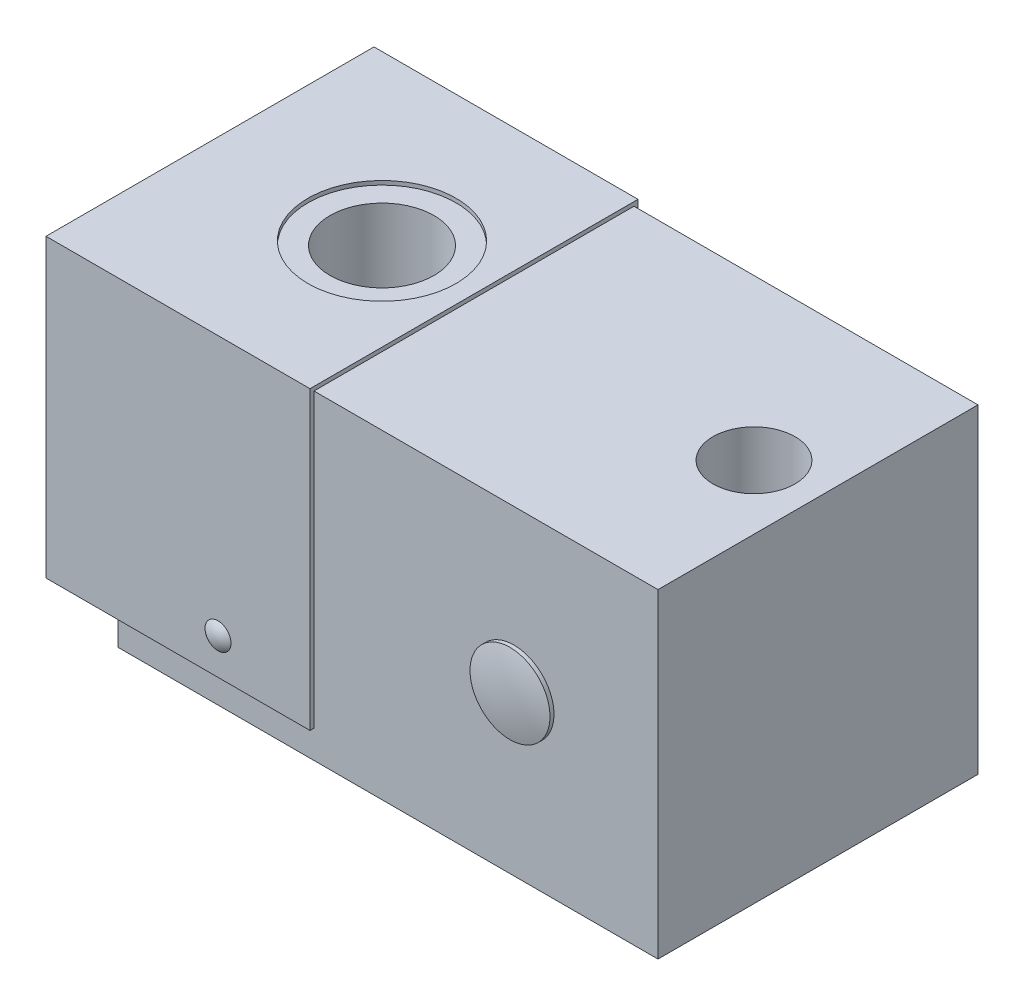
from build123d import *
from build123d.topology import SkipClean

# Parameters (mm, degrees)
EXTRUDE1_DEPTH           = 81
CUT_EXTRUDE1_DEPTH       = 40
CUT_EXTRUDE1_DEPTH_BACK  = 40
SKETCH2_W                = 86
SKETCH2_H                = 2
CUT_EXTRUDE2_DEPTH       = 40
CUT_EXTRUDE2_DEPTH_BACK  = 40
SKETCH3_W                = 33
SKETCH3_H                = 80
SKETCH4_W                = 2
SKETCH4_H                = 7
CUT_EXTRUDE3_DEPTH       = 66
SKETCH5_W                = 2
SKETCH5_H                = 7
CUT_EXTRUDE4_DEPTH       = 66
SKETCH7_W                = 10.25
SKETCH7_H                = 80
CUT_EXTRUDE5_DEPTH       = 5
REVOLVE3_ANGLE           = 90
REVOLVE3_OTHER_WAY_ANGLE = 90
REVOLVE4_ANGLE           = 90
REVOLVE4_OTHER_WAY_ANGLE = 90
SKETCH20_R               = 4.55
CUT_EXTRUDE6_DEPTH       = 4.5
CUT_EXTRUDE7_DEPTH       = 5


with BuildPart() as part:
    # Sketch1 → Extrude1 (new body)
    with BuildSketch(Plane(origin=(0, 0, 0), x_dir=(-1, 0, 0), z_dir=(0, 1, 0))):
        Polygon((66, 41), (0, 41), (0, 40), (-86, 40), (-86, -40), (0, -40), (0, -41), (66, -41), align=None)
    extrude(amount=EXTRUDE1_DEPTH)

    # Sketch2 → Cut-Extrude1 (cut, two sides: drawn at the far end of the back side and taken through both)
    with BuildSketch(Plane.XY.offset(-CUT_EXTRUDE1_DEPTH_BACK)):
        with Locations((43, 81)):
            Rectangle(SKETCH2_W, SKETCH2_H)
    extrude(amount=CUT_EXTRUDE1_DEPTH + CUT_EXTRUDE1_DEPTH_BACK, mode=Mode.SUBTRACT)

    # Sketch3 → Cut-Extrude2 (cut, two sides: drawn at the far end of the back side and taken through both)
    with BuildSketch(Plane.XY.offset(-CUT_EXTRUDE2_DEPTH_BACK)):
        with Locations((-65.5, 40)):
            Rectangle(SKETCH3_W, SKETCH3_H)
    extrude(amount=CUT_EXTRUDE2_DEPTH + CUT_EXTRUDE2_DEPTH_BACK, mode=Mode.SUBTRACT)

    # Sketch4 → Cut-Extrude3 (cut)
    with BuildSketch(Plane(origin=(0, 0, 0), x_dir=(0, 0, -1), z_dir=(1, 0, 0))):
        with Locations((41, 3.5)):
            Rectangle(SKETCH4_W, SKETCH4_H)
    extrude(amount=-CUT_EXTRUDE3_DEPTH, mode=Mode.SUBTRACT)

    # Sketch5 → Cut-Extrude4 (cut)
    with BuildSketch(Plane(origin=(0, 0, 0), x_dir=(0, 0, -1), z_dir=(1, 0, 0))):
        with Locations((-41, 3.5)):
            Rectangle(SKETCH5_W, SKETCH5_H)
    extrude(amount=-CUT_EXTRUDE4_DEPTH, mode=Mode.SUBTRACT)

    # Sketch6 → Cut-Revolve1 (revolve, cut)
    with BuildSketch(Plane.XY, mode=Mode.PRIVATE) as cut_revolve1_sk:
        Polygon((-76, 40), (-76, 62), (14, 62), (14, 60.25), (44, 60.25), (53.442730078, 40), align=None)
    revolve(cut_revolve1_sk.sketch.rotate(Axis((53.442730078, 40, 0), (-1, 0, 0)), 270), axis=Axis((53.442730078, 40, 0), (-1, 0, 0)), mode=Mode.SUBTRACT)

    # Sketch7 → Cut-Revolve2 (revolve, cut)
    with BuildSketch(Plane.XY, mode=Mode.PRIVATE) as cut_revolve2_sk:
        with Locations((75.125, 40)):
            Rectangle(SKETCH7_W, SKETCH7_H)
    revolve(cut_revolve2_sk.sketch.rotate(Axis((70, 0, 0), (0, 1, 0)), 270), axis=Axis((70, 0, 0), (0, 1, 0)), mode=Mode.SUBTRACT)

    # Sketch8 → Cut-Revolve3 (revolve, cut)
    with BuildSketch(Plane.XY.offset(30), mode=Mode.PRIVATE) as cut_revolve3_sk:
        Polygon((70, 30.91735091), (75.053, 28), (75.053, 0.947), (76, 0), (70, 0), align=None)
    revolve(cut_revolve3_sk.sketch.rotate(Axis((70, 0, 30), (0, 1, 0)), 270), axis=Axis((70, 0, 30), (0, 1, 0)), mode=Mode.SUBTRACT)

    # Sketch9 → Cut-Revolve4 (revolve, cut)
    with BuildSketch(Plane.XY.offset(30), mode=Mode.PRIVATE) as cut_revolve4_sk:
        Polygon((-34, 30.91735091), (-28.947, 28), (-28.947, 0.947), (-28, 0), (-34, 0), align=None)
    revolve(cut_revolve4_sk.sketch.rotate(Axis((-34, 0, 30), (0, 1, 0)), 270), axis=Axis((-34, 0, 30), (0, 1, 0)), mode=Mode.SUBTRACT)

    # Sketch10 → Cut-Revolve5 (revolve, cut)
    with BuildSketch(Plane.XY.offset(-30), mode=Mode.PRIVATE) as cut_revolve5_sk:
        Polygon((70, 30.91735091), (75.053, 28), (75.053, 0.947), (76, 0), (70, 0), align=None)
    revolve(cut_revolve5_sk.sketch.rotate(Axis((70, 0, -30), (0, 1, 0)), 270), axis=Axis((70, 0, -30), (0, 1, 0)), mode=Mode.SUBTRACT)

    # Sketch11 → Cut-Revolve6 (revolve, cut)
    with BuildSketch(Plane.XY.offset(-30), mode=Mode.PRIVATE) as cut_revolve6_sk:
        Polygon((-34, 30.91735091), (-28.947, 28), (-28.947, 0.947), (-28, 0), (-34, 0), align=None)
    revolve(cut_revolve6_sk.sketch.rotate(Axis((-34, 0, -30), (0, 1, 0)), 270), axis=Axis((-34, 0, -30), (0, 1, 0)), mode=Mode.SUBTRACT)

    # Sketch12 → Cut-Revolve7 (revolve, cut)
    with BuildSketch(Plane.XY, mode=Mode.PRIVATE) as cut_revolve7_sk:
        Polygon((-23, 81), (-4.5, 81), (-4.5, 80), (-10, 80), (-10, 0), (-23, 0), align=None)
    revolve(cut_revolve7_sk.sketch.rotate(Axis((-23, 0, 0), (0, 1, 0)), 270), axis=Axis((-23, 0, 0), (0, 1, 0)), mode=Mode.SUBTRACT)

    # Sketch13 → Cut-Revolve8 (revolve, cut)
    with BuildSketch(Plane(origin=(50, 0, 0), x_dir=(0, 0, -1), z_dir=(1, 0, 0)), mode=Mode.PRIVATE) as cut_revolve8_sk:
        Polygon((40, 40), (40, 33.4215), (39.144, 34.2775), (-39.144, 34.2775), (-40, 33.4215), (-40, 40), align=None)
    revolve(cut_revolve8_sk.sketch.rotate(Axis((50, 40, 40), (0, 0, -1)), 90), axis=Axis((50, 40, 40), (0, 0, -1)), mode=Mode.SUBTRACT)

    # Sketch14 → Revolve1 (revolve)
    with BuildSketch(Plane(origin=(50, 0, 0), x_dir=(0, 0, -1), z_dir=(1, 0, 0)), mode=Mode.PRIVATE) as revolve1_sk:
        with BuildLine():
            Line((-30, 40), (-30, 34.2775))
            Line((-30, 34.2775), (-40, 34.2775))
            Line((-40, 34.2775), (-40, 30))
            Line((-40, 30), (-41, 30))
            ThreePointArc((-41, 30), (-41.951354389, 34.959828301), (-42.270166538, 40))
            Line((-42.270166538, 40), (-30, 40))
        make_face()
    revolve(revolve1_sk.sketch.rotate(Axis((50, 40, 42.270166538), (0, 0, -1)), 90), axis=Axis((50, 40, 42.270166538), (0, 0, -1)))

    # Sketch15 → Revolve2 (revolve)
    with BuildSketch(Plane(origin=(50, 0, 0), x_dir=(0, 0, -1), z_dir=(1, 0, 0)), mode=Mode.PRIVATE) as revolve2_sk:
        Polygon((42, 40), (42, 31), (40, 31), (40, 35.136), (30, 35.136), (30, 40), align=None)
    revolve(revolve2_sk.sketch.rotate(Axis((50, 40, -30), (0, 0, -1)), 90), axis=Axis((50, 40, -30), (0, 0, -1)))

    # Sketch16 → Cut-Extrude5 (cut)
    with BuildSketch(Plane(origin=(0, 0, -42), x_dir=(-1, 0, 0), z_dir=(0, 0, -1))):
        Polygon((-47.979274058, 43.5), (-52.020725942, 43.5), (-54.041451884, 40), (-52.020725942, 36.5), (-47.979274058, 36.5), (-45.958548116, 40), align=None)
    extrude(amount=-CUT_EXTRUDE5_DEPTH, mode=Mode.SUBTRACT)

    # Sketch17 → Revolve3 (revolve)
    with BuildSketch(Plane(origin=(-23, 0, 0), x_dir=(0, 0, -1), z_dir=(1, 0, 0))):
        with BuildLine():
            Line((-37.2, 21), (-37.2, 11))
            ThreePointArc((-37.2, 11), (-42.2, 16), (-37.2, 21))
        make_face()
    revolve(axis=Axis((-23, 21, 37.2), (0, -1, 0)), revolution_arc=REVOLVE3_ANGLE)

    # Sketch17 → Revolve3 other way (revolve)
    with SkipClean():  # the faces are left unmerged after this step: merging them gives an invalid solid
        with BuildSketch(Plane(origin=(-23, 0, 0), x_dir=(0, 0, -1), z_dir=(1, 0, 0))):
            with BuildLine():
                Line((-37.2, 21), (-37.2, 11))
                ThreePointArc((-37.2, 11), (-42.2, 16), (-37.2, 21))
            make_face()
        revolve(axis=Axis((-23, 21, 37.2), (0, 1, 0)), revolution_arc=REVOLVE3_OTHER_WAY_ANGLE)

    # Sketch18 → Revolve4 (revolve)
    with SkipClean():  # the faces are left unmerged after this step: merging them gives an invalid solid
        with BuildSketch(Plane(origin=(-23, 0, 0), x_dir=(0, 0, -1), z_dir=(1, 0, 0))):
            with BuildLine():
                Line((37.2, 11), (37.2, 21))
                ThreePointArc((37.2, 21), (42.2, 16), (37.2, 11))
            make_face()
        revolve(axis=Axis((-23, 11, -37.2), (0, 1, 0)), revolution_arc=REVOLVE4_ANGLE)

    # Sketch18 → Revolve4 other way (revolve)
    with SkipClean():  # the faces are left unmerged after this step: merging them gives an invalid solid
        with BuildSketch(Plane(origin=(-23, 0, 0), x_dir=(0, 0, -1), z_dir=(1, 0, 0))):
            with BuildLine():
                Line((37.2, 11), (37.2, 21))
                ThreePointArc((37.2, 21), (42.2, 16), (37.2, 11))
            make_face()
        revolve(axis=Axis((-23, 11, -37.2), (0, -1, 0)), revolution_arc=REVOLVE4_OTHER_WAY_ANGLE)

    # Sketch19 → Cut-Revolve9 (revolve, cut)
    with SkipClean():  # the faces are left unmerged after this step: merging them gives an invalid solid
        with BuildSketch(Plane.XY, mode=Mode.PRIVATE) as cut_revolve9_sk:
            Polygon((49, 40), (51.01, 40), (51.01, 2), (56, 2), (56, 0), (49, 0), align=None)
        revolve(cut_revolve9_sk.sketch.rotate(Axis((49, 0, 0), (0, 1, 0)), 270), axis=Axis((49, 0, 0), (0, 1, 0)), mode=Mode.SUBTRACT)

    # Sketch20 → Cut-Extrude6 (cut)
    with SkipClean():  # the faces are left unmerged after this step: merging them gives an invalid solid
        with BuildSketch(Plane.XZ.offset(-2)):
            with Locations(Location((49, 0, 0), (0, 0, 270))):
                Circle(SKETCH20_R)
        extrude(amount=-CUT_EXTRUDE6_DEPTH, mode=Mode.SUBTRACT)

    # Sketch21 → Revolve5 (revolve)
    with SkipClean():  # the faces are left unmerged after this step: merging them gives an invalid solid
        with BuildSketch(Plane.XY, mode=Mode.PRIVATE) as revolve5_sk:
            with BuildLine():
                Line((49, 16.5), (51, 16.5))
                Line((51, 16.5), (51.5, 16))
                Line((51.5, 16), (51.5, 6.5))
                Line((51.5, 6.5), (53.25, 6.5))
                Line((53.25, 6.5), (53.25, 2))
                ThreePointArc((53.25, 2), (53.103553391, 1.646446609), (52.75, 1.5))
                Line((52.75, 1.5), (49, 1.5))
                Line((49, 1.5), (49, 16.5))
            make_face()
        revolve(revolve5_sk.sketch.rotate(Axis((49, 1.5, 0), (0, 1, 0)), 331.078530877), axis=Axis((49, 1.5, 0), (0, 1, 0)))

    # Sketch22 → Cut-Extrude7 (cut)
    with SkipClean():  # the faces are left unmerged after this step: merging them gives an invalid solid
        with BuildSketch(Plane.XZ.offset(-1.5)):
            Polygon((46.5, 1.443375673), (46.5, -1.443375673), (49, -2.886751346), (51.5, -1.443375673), (51.5, 1.443375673), (49, 2.886751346), align=None)
        extrude(amount=-CUT_EXTRUDE7_DEPTH, mode=Mode.SUBTRACT)


solid = part.part
